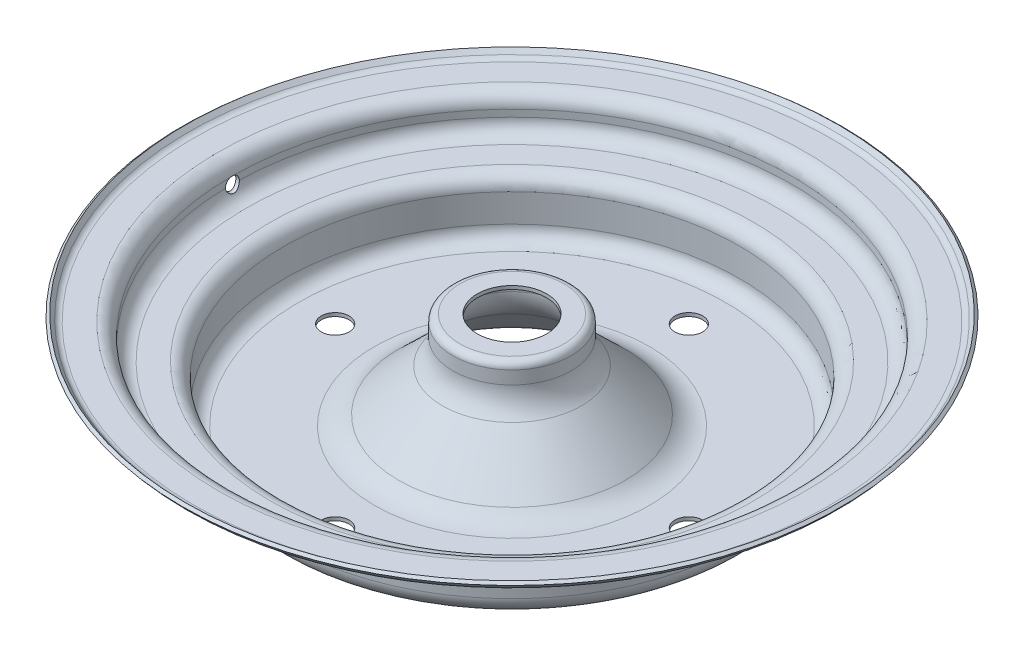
ISO-10303-21;
HEADER;
FILE_DESCRIPTION(('STEP AP214'),'2;1');
FILE_NAME('part.step','',(''),(''),'','','');
FILE_SCHEMA(('AUTOMOTIVE_DESIGN { 1 0 10303 214 1 1 1 1 }'));
ENDSEC;
DATA;
#1=APPLICATION_CONTEXT('core data for automotive mechanical design processes');
#2=APPLICATION_PROTOCOL_DEFINITION('international standard','automotive_design',2000,#1);
#3=PRODUCT_CONTEXT('',#1,'mechanical');
#4=PRODUCT('Part','Part','',(#3));
#5=PRODUCT_RELATED_PRODUCT_CATEGORY('part','',(#4));
#6=PRODUCT_DEFINITION_FORMATION('','',#4);
#7=PRODUCT_DEFINITION_CONTEXT('part definition',#1,'design');
#8=PRODUCT_DEFINITION('design','',#6,#7);
#9=PRODUCT_DEFINITION_SHAPE('','',#8);
#10=(LENGTH_UNIT() NAMED_UNIT(*) SI_UNIT(.MILLI.,.METRE.));
#11=(NAMED_UNIT(*) PLANE_ANGLE_UNIT() SI_UNIT($,.RADIAN.));
#12=(NAMED_UNIT(*) SI_UNIT($,.STERADIAN.) SOLID_ANGLE_UNIT());
#13=UNCERTAINTY_MEASURE_WITH_UNIT(LENGTH_MEASURE(1.E-05),#10,'distance_accuracy_value','');
#14=(GEOMETRIC_REPRESENTATION_CONTEXT(3) GLOBAL_UNCERTAINTY_ASSIGNED_CONTEXT((#13)) GLOBAL_UNIT_ASSIGNED_CONTEXT((#10,
#11,#12)) REPRESENTATION_CONTEXT('',''));
#15=CARTESIAN_POINT('',(0.,0.,0.));
#16=DIRECTION('',(0.,0.,1.));
#17=DIRECTION('',(1.,0.,0.));
#18=AXIS2_PLACEMENT_3D('',#15,#16,#17);
#19=CARTESIAN_POINT('',(0.,39.6036389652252,0.));
#20=DIRECTION('',(0.,1.,0.));
#21=DIRECTION('',(0.,0.,1.));
#22=AXIS2_PLACEMENT_3D('',#19,#20,#21);
#23=CYLINDRICAL_SURFACE('',#22,81.6269865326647);
#24=CARTESIAN_POINT('',(0.,26.7656449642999,0.));
#25=DIRECTION('',(0.,1.,0.));
#26=DIRECTION('',(0.,0.,1.));
#27=AXIS2_PLACEMENT_3D('',#24,#25,#26);
#28=CIRCLE('',#27,81.6269865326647);
#29=CARTESIAN_POINT('',(-81.6024811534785,26.7656449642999,2.));
#30=VERTEX_POINT('',#29);
#31=CARTESIAN_POINT('',(-81.6024811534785,26.7656449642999,-2.));
#32=VERTEX_POINT('',#31);
#33=EDGE_CURVE('E248',#30,#32,#28,.T.);
#34=ORIENTED_EDGE('',*,*,#33,.T.);
#35=CARTESIAN_POINT('',(-81.6024811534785,26.7656449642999,-2.));
#36=CARTESIAN_POINT('',(-81.6024808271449,26.8219040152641,-1.99999963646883));
#37=CARTESIAN_POINT('',(-81.6025394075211,26.8781361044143,-1.99762470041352));
#38=CARTESIAN_POINT('',(-81.6027709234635,26.9901977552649,-1.98815017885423));
#39=CARTESIAN_POINT('',(-81.6029438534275,27.046027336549,-1.98105082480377));
#40=CARTESIAN_POINT('',(-81.6036282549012,27.212219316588,-1.95273292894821));
#41=CARTESIAN_POINT('',(-81.6043053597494,27.3214681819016,-1.92449437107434));
#42=CARTESIAN_POINT('',(-81.6060260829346,27.5336676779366,-1.85008268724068));
#43=CARTESIAN_POINT('',(-81.6070698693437,27.6366153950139,-1.80390133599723));
#44=CARTESIAN_POINT('',(-81.6094058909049,27.8332920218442,-1.69492164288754));
#45=CARTESIAN_POINT('',(-81.6106980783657,27.9270226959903,-1.63212648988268));
#46=CARTESIAN_POINT('',(-81.6133857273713,28.1026292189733,-1.4916832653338));
#47=CARTESIAN_POINT('',(-81.6147812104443,28.1845025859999,-1.41403209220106));
#48=CARTESIAN_POINT('',(-81.6175181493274,28.33406581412,-1.24607454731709));
#49=CARTESIAN_POINT('',(-81.6188595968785,28.4017535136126,-1.15576625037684));
#50=CARTESIAN_POINT('',(-81.6213371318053,28.5210119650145,-0.965057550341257));
#51=CARTESIAN_POINT('',(-81.6224732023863,28.5725813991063,-0.864656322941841));
#52=CARTESIAN_POINT('',(-81.6244116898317,28.658128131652,-0.656624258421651));
#53=CARTESIAN_POINT('',(-81.6252141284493,28.6921065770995,-0.548993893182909));
#54=CARTESIAN_POINT('',(-81.6263948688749,28.7415055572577,-0.329573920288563));
#55=CARTESIAN_POINT('',(-81.6267732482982,28.7569294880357,-0.217785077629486));
#56=CARTESIAN_POINT('',(-81.6270634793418,28.7687921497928,0.00679853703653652));
#57=CARTESIAN_POINT('',(-81.6269753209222,28.7652304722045,0.11959333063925));
#58=CARTESIAN_POINT('',(-81.6263424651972,28.7392252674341,0.342957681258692));
#59=CARTESIAN_POINT('',(-81.6257978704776,28.7167859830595,0.453527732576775));
#60=CARTESIAN_POINT('',(-81.6243136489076,28.6536691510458,0.669330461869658));
#61=CARTESIAN_POINT('',(-81.6233740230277,28.612991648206,0.774563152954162));
#62=CARTESIAN_POINT('',(-81.6212054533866,28.5145472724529,0.976720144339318));
#63=CARTESIAN_POINT('',(-81.6199764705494,28.456778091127,1.07364332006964));
#64=CARTESIAN_POINT('',(-81.6173677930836,28.3257947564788,1.25641234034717));
#65=CARTESIAN_POINT('',(-81.615988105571,28.2525813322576,1.34225870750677));
#66=CARTESIAN_POINT('',(-81.6132332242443,28.0927758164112,1.50045578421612));
#67=CARTESIAN_POINT('',(-81.6118580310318,28.0061820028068,1.57280475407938));
#68=CARTESIAN_POINT('',(-81.6092669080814,27.8220416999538,1.70196168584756));
#69=CARTESIAN_POINT('',(-81.6080510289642,27.7244917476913,1.75876471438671));
#70=CARTESIAN_POINT('',(-81.6059155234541,27.5211949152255,1.85521423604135));
#71=CARTESIAN_POINT('',(-81.6049960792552,27.4154430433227,1.89485018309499));
#72=CARTESIAN_POINT('',(-81.6035596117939,27.1988654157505,1.95574340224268));
#73=CARTESIAN_POINT('',(-81.6030419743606,27.0880476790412,1.97702872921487));
#74=CARTESIAN_POINT('',(-81.6026626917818,26.9413502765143,1.9925802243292));
#75=CARTESIAN_POINT('',(-81.6025946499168,26.9062360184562,1.99536410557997));
#76=CARTESIAN_POINT('',(-81.6025039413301,26.8359675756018,1.99907145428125));
#77=CARTESIAN_POINT('',(-81.6024811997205,26.8008135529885,1.99999799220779));
#78=CARTESIAN_POINT('',(-81.6024811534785,26.7656449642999,2.));
#79=B_SPLINE_CURVE_WITH_KNOTS('',3,(#35,#36,#37,#38,#39,#40,#41,#42,#43,#44,#45,#46,#47,#48,#49,
#50,#51,#52,#53,#54,#55,#56,#57,#58,#59,#60,#61,#62,#63,#64,#65,#66,#67,#68,#69,#70,#71,#72,#73,
#74,#75,#76,#77,#78),.UNSPECIFIED.,.F.,.F.,(4,2,2,2,2,2,2,2,2,2,2,2,2,2,2,2,2,2,2,2,2,4),(0.,
0.168673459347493,0.337338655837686,0.674126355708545,1.01106862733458,1.34794627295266,
1.68489432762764,2.02189368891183,2.3589205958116,2.69592552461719,3.03286876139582,
3.36981924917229,3.70669402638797,4.04356797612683,4.38048744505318,4.71739101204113,
5.05433797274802,5.39139173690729,5.7286522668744,6.06539626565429,6.17103547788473,
6.27649990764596),.UNSPECIFIED.);
#80=CARTESIAN_POINT('',(-81.6269865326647,28.7656449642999,0.));
#81=VERTEX_POINT('',#80);
#82=EDGE_CURVE('E52',#32,#81,#79,.T.);
#83=ORIENTED_EDGE('',*,*,#82,.T.);
#84=CARTESIAN_POINT('',(0.,28.7656449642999,0.));
#85=DIRECTION('',(0.,1.,0.));
#86=DIRECTION('',(0.,0.,1.));
#87=AXIS2_PLACEMENT_3D('',#84,#85,#86);
#88=CIRCLE('',#87,81.6269865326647);
#89=EDGE_CURVE('E251',#81,#81,#88,.T.);
#90=ORIENTED_EDGE('',*,*,#89,.F.);
#91=EDGE_CURVE('E112',#81,#30,#79,.T.);
#92=ORIENTED_EDGE('',*,*,#91,.T.);
#93=EDGE_LOOP('',(#34,#83,#90,#92));
#94=FACE_BOUND('',#93,.T.);
#95=ADVANCED_FACE('F37',(#94),#23,.T.);
#96=CARTESIAN_POINT('',(0.,26.7656449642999,0.));
#97=DIRECTION('',(0.,1.,0.));
#98=DIRECTION('',(0.,0.,1.));
#99=AXIS2_PLACEMENT_3D('',#96,#97,#98);
#100=TOROIDAL_SURFACE('',#99,76.6269865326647,5.);
#101=CARTESIAN_POINT('',(0.,21.7656449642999,0.));
#102=DIRECTION('',(0.,1.,0.));
#103=DIRECTION('',(0.,0.,1.));
#104=AXIS2_PLACEMENT_3D('',#101,#102,#103);
#105=CIRCLE('',#104,76.6269865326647);
#106=CARTESIAN_POINT('',(0.,21.7656449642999,76.6269865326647));
#107=VERTEX_POINT('',#106);
#108=EDGE_CURVE('E245',#107,#107,#105,.T.);
#109=ORIENTED_EDGE('',*,*,#108,.T.);
#110=EDGE_LOOP('',(#109));
#111=FACE_BOUND('',#110,.T.);
#112=ORIENTED_EDGE('',*,*,#33,.F.);
#113=CARTESIAN_POINT('',(-81.6024811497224,26.7658449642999,1.99999999));
#114=CARTESIAN_POINT('',(-81.6024907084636,26.7116224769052,2.00001276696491));
#115=CARTESIAN_POINT('',(-81.6016571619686,26.6574044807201,1.99780593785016));
#116=CARTESIAN_POINT('',(-81.598359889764,26.5493891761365,1.98901010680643));
#117=CARTESIAN_POINT('',(-81.5958966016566,26.4955917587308,1.98242228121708));
#118=CARTESIAN_POINT('',(-81.5894060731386,26.3889681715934,1.96494903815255));
#119=CARTESIAN_POINT('',(-81.5853837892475,26.3361394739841,1.95407723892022));
#120=CARTESIAN_POINT('',(-81.5758859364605,26.2316656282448,1.92815111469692));
#121=CARTESIAN_POINT('',(-81.5704103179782,26.180020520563,1.91309664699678));
#122=CARTESIAN_POINT('',(-81.5520076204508,26.0274510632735,1.86186686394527));
#123=CARTESIAN_POINT('',(-81.5370944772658,25.9287345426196,1.81959892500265));
#124=CARTESIAN_POINT('',(-81.5034369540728,25.739827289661,1.72020955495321));
#125=CARTESIAN_POINT('',(-81.4846901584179,25.6496419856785,1.66307875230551));
#126=CARTESIAN_POINT('',(-81.4443952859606,25.4765125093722,1.53306568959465));
#127=CARTESIAN_POINT('',(-81.4227678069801,25.3939739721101,1.45966717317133));
#128=CARTESIAN_POINT('',(-81.3795107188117,25.2420458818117,1.30029862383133));
#129=CARTESIAN_POINT('',(-81.3578811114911,25.1726609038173,1.21432423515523));
#130=CARTESIAN_POINT('',(-81.3161341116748,25.0463195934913,1.02813522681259));
#131=CARTESIAN_POINT('',(-81.2961093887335,24.9899579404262,0.927494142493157));
#132=CARTESIAN_POINT('',(-81.2611119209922,24.8951449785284,0.717291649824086));
#133=CARTESIAN_POINT('',(-81.24613691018,24.8566856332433,0.607734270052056));
#134=CARTESIAN_POINT('',(-81.2238192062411,24.8003997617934,0.387535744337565));
#135=CARTESIAN_POINT('',(-81.2161870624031,24.7817873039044,0.277125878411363));
#136=CARTESIAN_POINT('',(-81.2085967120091,24.7632736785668,0.0545046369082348));
#137=CARTESIAN_POINT('',(-81.2086353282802,24.7633647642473,-0.0577059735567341));
#138=CARTESIAN_POINT('',(-81.2161250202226,24.7816387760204,-0.273304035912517));
#139=CARTESIAN_POINT('',(-81.2231146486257,24.7986954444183,-0.3768059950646));
#140=CARTESIAN_POINT('',(-81.2429368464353,24.8485547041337,-0.579350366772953));
#141=CARTESIAN_POINT('',(-81.2557702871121,24.8813596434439,-0.678392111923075));
#142=CARTESIAN_POINT('',(-81.2860881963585,24.9624010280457,-0.871489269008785));
#143=CARTESIAN_POINT('',(-81.3036589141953,25.0109273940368,-0.965408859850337));
#144=CARTESIAN_POINT('',(-81.3414218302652,25.1218369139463,-1.14409904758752));
#145=CARTESIAN_POINT('',(-81.3616149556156,25.1842249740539,-1.22886638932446));
#146=CARTESIAN_POINT('',(-81.4040423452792,25.3261795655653,-1.39302299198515));
#147=CARTESIAN_POINT('',(-81.4263210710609,25.4066370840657,-1.471632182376));
#148=CARTESIAN_POINT('',(-81.4692066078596,25.5798732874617,-1.61448139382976));
#149=CARTESIAN_POINT('',(-81.4898129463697,25.6726554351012,-1.67871736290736));
#150=CARTESIAN_POINT('',(-81.5274628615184,25.8698496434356,-1.79183562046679));
#151=CARTESIAN_POINT('',(-81.5444450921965,25.9744221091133,-1.84045965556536));
#152=CARTESIAN_POINT('',(-81.572490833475,26.1910154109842,-1.91912108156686));
#153=CARTESIAN_POINT('',(-81.5835631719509,26.3030248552,-1.94918620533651));
#154=CARTESIAN_POINT('',(-81.5948260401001,26.4744325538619,-1.97955159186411));
#155=CARTESIAN_POINT('',(-81.5976900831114,26.532441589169,-1.98721875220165));
#156=CARTESIAN_POINT('',(-81.6015206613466,26.6489044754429,-1.99744425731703));
#157=CARTESIAN_POINT('',(-81.6024893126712,26.7073577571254,-2.00000829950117));
#158=CARTESIAN_POINT('',(-81.6024811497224,26.7658449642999,-1.99999999));
#159=B_SPLINE_CURVE_WITH_KNOTS('',3,(#113,#114,#115,#116,#117,#118,#119,#120,#121,#122,#123,
#124,#125,#126,#127,#128,#129,#130,#131,#132,#133,#134,#135,#136,#137,#138,#139,#140,#141,#142,
#143,#144,#145,#146,#147,#148,#149,#150,#151,#152,#153,#154,#155,#156,#157,#158),.UNSPECIFIED.,
.F.,.F.,(4,2,2,2,2,2,2,2,2,2,2,2,2,2,2,2,2,2,2,2,2,2,4),(0.,0.162607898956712,0.32517215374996,
0.487223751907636,0.649280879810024,0.972919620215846,1.29676292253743,1.63291788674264,
1.96918955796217,2.31865919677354,2.66797180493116,3.00286988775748,3.33762925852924,
3.6515556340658,3.96552882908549,4.28565735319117,4.60589936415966,4.94833929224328,
5.29087563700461,5.63881675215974,5.98623666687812,6.16176337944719,6.33709401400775),.UNSPECIFIED.);
#160=EDGE_CURVE('E82',#30,#32,#159,.T.);
#161=ORIENTED_EDGE('',*,*,#160,.T.);
#162=EDGE_LOOP('',(#112,#161));
#163=FACE_BOUND('',#162,.T.);
#164=ADVANCED_FACE('F119',(#111,#163),#100,.T.);
#165=CARTESIAN_POINT('',(0.,26.7656449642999,0.));
#166=DIRECTION('',(0.,1.,0.));
#167=DIRECTION('',(0.,0.,1.));
#168=AXIS2_PLACEMENT_3D('',#165,#166,#167);
#169=TOROIDAL_SURFACE('',#168,76.6269865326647,4.);
#170=CARTESIAN_POINT('',(0.,22.7656449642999,0.));
#171=DIRECTION('',(0.,1.,0.));
#172=DIRECTION('',(0.,0.,1.));
#173=AXIS2_PLACEMENT_3D('',#170,#171,#172);
#174=CIRCLE('',#173,76.6269865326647);
#175=CARTESIAN_POINT('',(0.,22.7656449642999,76.6269865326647));
#176=VERTEX_POINT('',#175);
#177=EDGE_CURVE('E176',#176,#176,#174,.T.);
#178=ORIENTED_EDGE('',*,*,#177,.F.);
#179=EDGE_LOOP('',(#178));
#180=FACE_BOUND('',#179,.T.);
#181=CARTESIAN_POINT('',(0.,26.7656449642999,0.));
#182=DIRECTION('',(0.,1.,0.));
#183=DIRECTION('',(0.,0.,1.));
#184=AXIS2_PLACEMENT_3D('',#181,#182,#183);
#185=CIRCLE('',#184,80.6269865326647);
#186=CARTESIAN_POINT('',(-80.6021771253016,26.7656449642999,2.));
#187=VERTEX_POINT('',#186);
#188=CARTESIAN_POINT('',(-80.6021771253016,26.7656449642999,-2.));
#189=VERTEX_POINT('',#188);
#190=EDGE_CURVE('E81',#187,#189,#185,.T.);
#191=ORIENTED_EDGE('',*,*,#190,.T.);
#192=CARTESIAN_POINT('',(-80.6021771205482,26.7658449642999,-1.99999999));
#193=CARTESIAN_POINT('',(-80.6021884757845,26.7127679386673,-2.00001354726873));
#194=CARTESIAN_POINT('',(-80.6011780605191,26.6596963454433,-1.99789794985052));
#195=CARTESIAN_POINT('',(-80.5971798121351,26.553981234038,-1.98947241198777));
#196=CARTESIAN_POINT('',(-80.5941927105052,26.5013375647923,-1.98316402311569));
#197=CARTESIAN_POINT('',(-80.5863237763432,26.3970763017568,-1.96645215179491));
#198=CARTESIAN_POINT('',(-80.5814499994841,26.3454553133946,-1.95606607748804));
#199=CARTESIAN_POINT('',(-80.5699360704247,26.2433874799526,-1.93132294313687));
#200=CARTESIAN_POINT('',(-80.5632958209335,26.1929406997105,-1.91696566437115));
#201=CARTESIAN_POINT('',(-80.5409687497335,26.0439794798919,-1.86817659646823));
#202=CARTESIAN_POINT('',(-80.5228593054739,25.9476403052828,-1.82799432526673));
#203=CARTESIAN_POINT('',(-80.4818313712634,25.7631525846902,-1.73371742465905));
#204=CARTESIAN_POINT('',(-80.4589084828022,25.6750116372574,-1.67961006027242));
#205=CARTESIAN_POINT('',(-80.4088870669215,25.5039737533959,-1.55561713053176));
#206=CARTESIAN_POINT('',(-80.3816277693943,25.4216359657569,-1.48502474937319));
#207=CARTESIAN_POINT('',(-80.3265226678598,25.269462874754,-1.33158928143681));
#208=CARTESIAN_POINT('',(-80.2986765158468,25.1996352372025,-1.2487387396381));
#209=CARTESIAN_POINT('',(-80.2433046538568,25.0695332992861,-1.06613083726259));
#210=CARTESIAN_POINT('',(-80.2159392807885,25.0102765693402,-0.965594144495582));
#211=CARTESIAN_POINT('',(-80.1673540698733,24.9097550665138,-0.754526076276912));
#212=CARTESIAN_POINT('',(-80.1461299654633,24.8684777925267,-0.644001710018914));
#213=CARTESIAN_POINT('',(-80.114099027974,24.8076020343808,-0.422488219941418));
#214=CARTESIAN_POINT('',(-80.1027709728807,24.7869096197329,-0.311878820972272));
#215=CARTESIAN_POINT('',(-80.0904489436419,24.764440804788,-0.0882231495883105));
#216=CARTESIAN_POINT('',(-80.0894460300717,24.7626480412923,0.0248209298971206));
#217=CARTESIAN_POINT('',(-80.0974430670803,24.7771850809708,0.236753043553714));
#218=CARTESIAN_POINT('',(-80.1053521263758,24.791538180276,0.335827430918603));
#219=CARTESIAN_POINT('',(-80.1283696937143,24.8345690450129,0.529937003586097));
#220=CARTESIAN_POINT('',(-80.1434802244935,24.8632508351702,0.624971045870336));
#221=CARTESIAN_POINT('',(-80.1795269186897,24.9347041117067,0.811070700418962));
#222=CARTESIAN_POINT('',(-80.2005943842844,24.9777977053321,0.901986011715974));
#223=CARTESIAN_POINT('',(-80.2461446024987,25.0766213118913,1.07573203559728));
#224=CARTESIAN_POINT('',(-80.2706289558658,25.1323572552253,1.15855892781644));
#225=CARTESIAN_POINT('',(-80.3237170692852,25.2625442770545,1.32402116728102));
#226=CARTESIAN_POINT('',(-80.3524666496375,25.3384254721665,1.40548840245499));
#227=CARTESIAN_POINT('',(-80.4084706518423,25.5029742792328,1.55499987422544));
#228=CARTESIAN_POINT('',(-80.4357243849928,25.5916477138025,1.62303796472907));
#229=CARTESIAN_POINT('',(-80.4869856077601,25.7836408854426,1.74618697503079));
#230=CARTESIAN_POINT('',(-80.5108262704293,25.8873951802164,1.80069442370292));
#231=CARTESIAN_POINT('',(-80.5512364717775,26.1039817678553,1.89100818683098));
#232=CARTESIAN_POINT('',(-80.5678182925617,26.2167983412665,1.92684611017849));
#233=CARTESIAN_POINT('',(-80.5871372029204,26.4031483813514,1.96821780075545));
#234=CARTESIAN_POINT('',(-80.5927478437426,26.4750308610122,1.98010954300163));
#235=CARTESIAN_POINT('',(-80.6002824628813,26.6198717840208,1.99601497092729));
#236=CARTESIAN_POINT('',(-80.6022053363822,26.6928305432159,2.00002629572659));
#237=CARTESIAN_POINT('',(-80.6021771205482,26.7658449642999,1.99999999));
#238=B_SPLINE_CURVE_WITH_KNOTS('',3,(#192,#193,#194,#195,#196,#197,#198,#199,#200,#201,#202,
#203,#204,#205,#206,#207,#208,#209,#210,#211,#212,#213,#214,#215,#216,#217,#218,#219,#220,#221,
#222,#223,#224,#225,#226,#227,#228,#229,#230,#231,#232,#233,#234,#235,#236,#237),.UNSPECIFIED.,
.F.,.F.,(4,2,2,2,2,2,2,2,2,2,2,2,2,2,2,2,2,2,2,2,2,2,4),(0.,0.159169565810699,0.318280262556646,
0.476718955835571,0.635166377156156,0.951447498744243,1.26801890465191,1.60208851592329,
1.93636213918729,2.29415031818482,2.65168932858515,2.98900959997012,3.32603779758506,
3.62589947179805,3.92584542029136,4.23300128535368,4.54030153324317,4.88374201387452,
5.22733931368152,5.58425817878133,5.94057077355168,6.15930909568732,6.37811293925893),.UNSPECIFIED.);
#239=EDGE_CURVE('E60',#189,#187,#238,.T.);
#240=ORIENTED_EDGE('',*,*,#239,.T.);
#241=EDGE_LOOP('',(#191,#240));
#242=FACE_BOUND('',#241,.T.);
#243=ADVANCED_FACE('F123',(#180,#242),#169,.F.);
#244=CARTESIAN_POINT('',(0.,39.6036389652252,0.));
#245=DIRECTION('',(0.,1.,0.));
#246=DIRECTION('',(0.,0.,1.));
#247=AXIS2_PLACEMENT_3D('',#244,#245,#246);
#248=CYLINDRICAL_SURFACE('',#247,80.6269865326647);
#249=ORIENTED_EDGE('',*,*,#190,.F.);
#250=CARTESIAN_POINT('',(-80.6021771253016,26.7656449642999,2.));
#251=CARTESIAN_POINT('',(-80.6021767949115,26.8219037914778,1.99999963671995));
#252=CARTESIAN_POINT('',(-80.60223610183,26.8781356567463,1.99762471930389));
#253=CARTESIAN_POINT('',(-80.6024704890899,26.9901968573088,1.98815027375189));
#254=CARTESIAN_POINT('',(-80.6026455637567,27.0460262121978,1.9810509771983));
#255=CARTESIAN_POINT('',(-80.603338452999,27.2122174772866,1.95273332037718));
#256=CARTESIAN_POINT('',(-80.6040239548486,27.3214658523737,1.92449501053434));
#257=CARTESIAN_POINT('',(-80.6057660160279,27.5336643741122,1.85008402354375));
#258=CARTESIAN_POINT('',(-80.606822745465,27.6366116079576,1.803903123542));
#259=CARTESIAN_POINT('',(-80.6091877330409,27.8332873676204,1.69492453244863));
#260=CARTESIAN_POINT('',(-80.6104959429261,27.9270176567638,1.63213002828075));
#261=CARTESIAN_POINT('',(-80.613216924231,28.102623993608,1.491687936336));
#262=CARTESIAN_POINT('',(-80.614629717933,28.1844975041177,1.41403717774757));
#263=CARTESIAN_POINT('',(-80.6174006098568,28.3340611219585,1.24608043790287));
#264=CARTESIAN_POINT('',(-80.6187586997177,28.4017490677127,1.15577253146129));
#265=CARTESIAN_POINT('',(-80.6212669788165,28.5210083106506,0.965064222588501));
#266=CARTESIAN_POINT('',(-80.6224171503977,28.5725782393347,0.864662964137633));
#267=CARTESIAN_POINT('',(-80.6243797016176,28.6581259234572,0.656630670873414));
#268=CARTESIAN_POINT('',(-80.6251921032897,28.6921048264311,0.549000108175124));
#269=CARTESIAN_POINT('',(-80.6263875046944,28.7415045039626,0.329580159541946));
#270=CARTESIAN_POINT('',(-80.626770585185,28.7569287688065,0.217791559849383));
#271=CARTESIAN_POINT('',(-80.627064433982,28.7687921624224,-0.00679164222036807));
#272=CARTESIAN_POINT('',(-80.6269751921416,28.7652308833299,-0.119586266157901));
#273=CARTESIAN_POINT('',(-80.6263345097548,28.7392266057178,-0.342949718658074));
#274=CARTESIAN_POINT('',(-80.6257831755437,28.7167879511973,-0.453519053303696));
#275=CARTESIAN_POINT('',(-80.6242805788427,28.6536726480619,-0.669320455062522));
#276=CARTESIAN_POINT('',(-80.623329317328,28.6129960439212,-0.774552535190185));
#277=CARTESIAN_POINT('',(-80.6211338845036,28.5145535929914,-0.976708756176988));
#278=CARTESIAN_POINT('',(-80.6198896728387,28.4567853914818,-1.0736317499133));
#279=CARTESIAN_POINT('',(-80.6172486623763,28.3258041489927,-1.25640061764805));
#280=CARTESIAN_POINT('',(-80.6158518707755,28.2525918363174,-1.34224701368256));
#281=CARTESIAN_POINT('',(-80.6130628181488,28.0927880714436,-1.50044494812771));
#282=CARTESIAN_POINT('',(-80.6116705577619,28.006194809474,-1.57279465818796));
#283=CARTESIAN_POINT('',(-80.6090472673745,27.822055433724,-1.70195316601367));
#284=CARTESIAN_POINT('',(-80.607816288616,27.7245058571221,-1.75875703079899));
#285=CARTESIAN_POINT('',(-80.6056542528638,27.5212095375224,-1.85520828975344));
#286=CARTESIAN_POINT('',(-80.6047233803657,27.4154578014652,-1.89484513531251));
#287=CARTESIAN_POINT('',(-80.6032690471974,27.1988802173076,-1.95574013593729));
#288=CARTESIAN_POINT('',(-80.6027449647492,27.0880623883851,-1.97702634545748));
#289=CARTESIAN_POINT('',(-80.6023609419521,26.9413624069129,-1.99257919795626));
#290=CARTESIAN_POINT('',(-80.6022920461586,26.9062457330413,-1.99536346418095));
#291=CARTESIAN_POINT('',(-80.6022001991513,26.8359724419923,-1.99907132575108));
#292=CARTESIAN_POINT('',(-80.6021771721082,26.8008159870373,-1.99999799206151));
#293=CARTESIAN_POINT('',(-80.6021771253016,26.7656449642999,-2.));
#294=B_SPLINE_CURVE_WITH_KNOTS('',3,(#250,#251,#252,#253,#254,#255,#256,#257,#258,#259,#260,
#261,#262,#263,#264,#265,#266,#267,#268,#269,#270,#271,#272,#273,#274,#275,#276,#277,#278,#279,
#280,#281,#282,#283,#284,#285,#286,#287,#288,#289,#290,#291,#292,#293),.UNSPECIFIED.,.F.,.F.,(4,
2,2,2,2,2,2,2,2,2,2,2,2,2,2,2,2,2,2,2,2,4),(0.,0.168672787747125,0.337337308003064,
0.674123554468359,1.01106432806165,1.34794051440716,1.68488868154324,2.02188815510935,
2.3589162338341,2.69592232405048,3.03286501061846,3.36981493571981,3.70668734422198,
4.04355893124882,4.38047695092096,4.71737908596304,5.05432682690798,5.39138136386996,
5.72864271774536,6.06538754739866,6.17103407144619,6.27650579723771),.UNSPECIFIED.);
#295=CARTESIAN_POINT('',(-80.6269865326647,28.7656449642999,0.));
#296=VERTEX_POINT('',#295);
#297=EDGE_CURVE('E72',#187,#296,#294,.T.);
#298=ORIENTED_EDGE('',*,*,#297,.T.);
#299=CARTESIAN_POINT('',(0.,28.7656449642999,0.));
#300=DIRECTION('',(0.,1.,0.));
#301=DIRECTION('',(0.,0.,1.));
#302=AXIS2_PLACEMENT_3D('',#299,#300,#301);
#303=CIRCLE('',#302,80.6269865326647);
#304=EDGE_CURVE('E80',#296,#296,#303,.T.);
#305=ORIENTED_EDGE('',*,*,#304,.T.);
#306=EDGE_CURVE('E69',#296,#189,#294,.T.);
#307=ORIENTED_EDGE('',*,*,#306,.T.);
#308=EDGE_LOOP('',(#249,#298,#305,#307));
#309=FACE_BOUND('',#308,.T.);
#310=ADVANCED_FACE('F78',(#309),#248,.F.);
#311=CARTESIAN_POINT('',(0.,34.6807560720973,0.));
#312=DIRECTION('',(0.,-1.,0.));
#313=DIRECTION('',(0.,0.,-1.));
#314=AXIS2_PLACEMENT_3D('',#311,#312,#313);
#315=CONICAL_SURFACE('',#314,94.233955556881,0.872664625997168);
#316=CARTESIAN_POINT('',(0.,34.0379684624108,0.));
#317=DIRECTION('',(0.,1.,0.));
#318=DIRECTION('',(0.,0.,1.));
#319=AXIS2_PLACEMENT_3D('',#316,#317,#318);
#320=CIRCLE('',#319,95.);
#321=CARTESIAN_POINT('',(0.,34.0379684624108,95.));
#322=VERTEX_POINT('',#321);
#323=EDGE_CURVE('E11',#322,#322,#320,.T.);
#324=ORIENTED_EDGE('',*,*,#323,.T.);
#325=EDGE_LOOP('',(#324));
#326=FACE_BOUND('',#325,.T.);
#327=CARTESIAN_POINT('',(0.,34.6807560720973,0.));
#328=DIRECTION('',(0.,1.,0.));
#329=DIRECTION('',(0.,0.,1.));
#330=AXIS2_PLACEMENT_3D('',#327,#328,#329);
#331=CIRCLE('',#330,94.233955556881);
#332=CARTESIAN_POINT('',(0.,34.6807560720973,94.233955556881));
#333=VERTEX_POINT('',#332);
#334=EDGE_CURVE('E156',#333,#333,#331,.T.);
#335=ORIENTED_EDGE('',*,*,#334,.F.);
#336=EDGE_LOOP('',(#335));
#337=FACE_BOUND('',#336,.T.);
#338=ADVANCED_FACE('F39',(#326,#337),#315,.T.);
#339=CARTESIAN_POINT('',(0.,34.0379684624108,0.));
#340=DIRECTION('',(0.,1.,0.));
#341=DIRECTION('',(0.,0.,1.));
#342=AXIS2_PLACEMENT_3D('',#339,#340,#341);
#343=CONICAL_SURFACE('',#342,95.,0.698131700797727);
#344=CARTESIAN_POINT('',(0.,32.8372821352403,0.));
#345=DIRECTION('',(0.,1.,0.));
#346=DIRECTION('',(0.,0.,1.));
#347=AXIS2_PLACEMENT_3D('',#344,#345,#346);
#348=CIRCLE('',#347,93.9925045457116);
#349=CARTESIAN_POINT('',(0.,32.8372821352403,93.9925045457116));
#350=VERTEX_POINT('',#349);
#351=EDGE_CURVE('E45',#350,#350,#348,.T.);
#352=ORIENTED_EDGE('',*,*,#351,.T.);
#353=EDGE_LOOP('',(#352));
#354=FACE_BOUND('',#353,.T.);
#355=ORIENTED_EDGE('',*,*,#323,.F.);
#356=EDGE_LOOP('',(#355));
#357=FACE_BOUND('',#356,.T.);
#358=ADVANCED_FACE('F141',(#354,#357),#343,.T.);
#359=CARTESIAN_POINT('',(0.,34.7656449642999,0.));
#360=DIRECTION('',(0.,1.,0.));
#361=DIRECTION('',(0.,0.,1.));
#362=AXIS2_PLACEMENT_3D('',#359,#360,#361);
#363=TOROIDAL_SURFACE('',#362,91.6943712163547,3.);
#364=CARTESIAN_POINT('',(0.,31.7656449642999,0.));
#365=DIRECTION('',(0.,1.,0.));
#366=DIRECTION('',(0.,0.,1.));
#367=AXIS2_PLACEMENT_3D('',#364,#365,#366);
#368=CIRCLE('',#367,91.6943712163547);
#369=CARTESIAN_POINT('',(0.,31.7656449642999,91.6943712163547));
#370=VERTEX_POINT('',#369);
#371=EDGE_CURVE('E257',#370,#370,#368,.T.);
#372=ORIENTED_EDGE('',*,*,#371,.T.);
#373=EDGE_LOOP('',(#372));
#374=FACE_BOUND('',#373,.T.);
#375=ORIENTED_EDGE('',*,*,#351,.F.);
#376=EDGE_LOOP('',(#375));
#377=FACE_BOUND('',#376,.T.);
#378=ADVANCED_FACE('F138',(#374,#377),#363,.T.);
#379=CARTESIAN_POINT('',(-91.6943712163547,31.7656449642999,0.));
#380=DIRECTION('',(0.,-1.,0.));
#381=DIRECTION('',(0.,0.,-1.));
#382=AXIS2_PLACEMENT_3D('',#379,#380,#381);
#383=PLANE('',#382);
#384=CARTESIAN_POINT('',(0.,31.7656449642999,0.));
#385=DIRECTION('',(0.,1.,0.));
#386=DIRECTION('',(0.,0.,1.));
#387=AXIS2_PLACEMENT_3D('',#384,#385,#386);
#388=CIRCLE('',#387,84.6269865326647);
#389=CARTESIAN_POINT('',(0.,31.7656449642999,84.6269865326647));
#390=VERTEX_POINT('',#389);
#391=EDGE_CURVE('E254',#390,#390,#388,.T.);
#392=ORIENTED_EDGE('',*,*,#391,.T.);
#393=EDGE_LOOP('',(#392));
#394=FACE_BOUND('',#393,.T.);
#395=ORIENTED_EDGE('',*,*,#371,.F.);
#396=EDGE_LOOP('',(#395));
#397=FACE_BOUND('',#396,.T.);
#398=ADVANCED_FACE('F134',(#394,#397),#383,.T.);
#399=CARTESIAN_POINT('',(0.,28.7656449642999,0.));
#400=DIRECTION('',(0.,1.,0.));
#401=DIRECTION('',(0.,0.,1.));
#402=AXIS2_PLACEMENT_3D('',#399,#400,#401);
#403=TOROIDAL_SURFACE('',#402,84.6269865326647,3.);
#404=ORIENTED_EDGE('',*,*,#89,.T.);
#405=EDGE_LOOP('',(#404));
#406=FACE_BOUND('',#405,.T.);
#407=ORIENTED_EDGE('',*,*,#391,.F.);
#408=EDGE_LOOP('',(#407));
#409=FACE_BOUND('',#408,.T.);
#410=ADVANCED_FACE('F131',(#406,#409),#403,.F.);
#411=CARTESIAN_POINT('',(-76.6269865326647,21.7656449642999,0.));
#412=DIRECTION('',(0.,-1.,0.));
#413=DIRECTION('',(0.,0.,-1.));
#414=AXIS2_PLACEMENT_3D('',#411,#412,#413);
#415=PLANE('',#414);
#416=CARTESIAN_POINT('',(0.,21.7656449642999,0.));
#417=DIRECTION('',(0.,1.,0.));
#418=DIRECTION('',(0.,0.,1.));
#419=AXIS2_PLACEMENT_3D('',#416,#417,#418);
#420=CIRCLE('',#419,69.6269865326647);
#421=CARTESIAN_POINT('',(0.,21.7656449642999,69.6269865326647));
#422=VERTEX_POINT('',#421);
#423=EDGE_CURVE('E242',#422,#422,#420,.T.);
#424=ORIENTED_EDGE('',*,*,#423,.T.);
#425=EDGE_LOOP('',(#424));
#426=FACE_BOUND('',#425,.T.);
#427=ORIENTED_EDGE('',*,*,#108,.F.);
#428=EDGE_LOOP('',(#427));
#429=FACE_BOUND('',#428,.T.);
#430=ADVANCED_FACE('F125',(#426,#429),#415,.T.);
#431=CARTESIAN_POINT('',(0.,18.7656449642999,0.));
#432=DIRECTION('',(0.,1.,0.));
#433=DIRECTION('',(0.,0.,1.));
#434=AXIS2_PLACEMENT_3D('',#431,#432,#433);
#435=TOROIDAL_SURFACE('',#434,69.6269865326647,3.);
#436=CARTESIAN_POINT('',(0.,18.7656449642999,0.));
#437=DIRECTION('',(0.,1.,0.));
#438=DIRECTION('',(0.,0.,1.));
#439=AXIS2_PLACEMENT_3D('',#436,#437,#438);
#440=CIRCLE('',#439,66.6269865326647);
#441=CARTESIAN_POINT('',(0.,18.7656449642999,66.6269865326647));
#442=VERTEX_POINT('',#441);
#443=EDGE_CURVE('E239',#442,#442,#440,.T.);
#444=ORIENTED_EDGE('',*,*,#443,.T.);
#445=EDGE_LOOP('',(#444));
#446=FACE_BOUND('',#445,.T.);
#447=ORIENTED_EDGE('',*,*,#423,.F.);
#448=EDGE_LOOP('',(#447));
#449=FACE_BOUND('',#448,.T.);
#450=ADVANCED_FACE('F313',(#446,#449),#435,.F.);
#451=CARTESIAN_POINT('',(0.,39.6036389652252,0.));
#452=DIRECTION('',(0.,1.,0.));
#453=DIRECTION('',(0.,0.,1.));
#454=AXIS2_PLACEMENT_3D('',#451,#452,#453);
#455=CYLINDRICAL_SURFACE('',#454,66.6269865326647);
#456=CARTESIAN_POINT('',(0.,10.6807560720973,0.));
#457=DIRECTION('',(0.,1.,0.));
#458=DIRECTION('',(0.,0.,1.));
#459=AXIS2_PLACEMENT_3D('',#456,#457,#458);
#460=CIRCLE('',#459,66.6269865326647);
#461=CARTESIAN_POINT('',(0.,10.6807560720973,66.6269865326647));
#462=VERTEX_POINT('',#461);
#463=EDGE_CURVE('E236',#462,#462,#460,.T.);
#464=ORIENTED_EDGE('',*,*,#463,.T.);
#465=EDGE_LOOP('',(#464));
#466=FACE_BOUND('',#465,.T.);
#467=ORIENTED_EDGE('',*,*,#443,.F.);
#468=EDGE_LOOP('',(#467));
#469=FACE_BOUND('',#468,.T.);
#470=ADVANCED_FACE('F307',(#466,#469),#455,.T.);
#471=CARTESIAN_POINT('',(0.,10.6807560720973,0.));
#472=DIRECTION('',(0.,1.,0.));
#473=DIRECTION('',(0.,0.,1.));
#474=AXIS2_PLACEMENT_3D('',#471,#472,#473);
#475=TOROIDAL_SURFACE('',#474,61.6269865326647,5.);
#476=CARTESIAN_POINT('',(0.,5.68075607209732,0.));
#477=DIRECTION('',(0.,1.,0.));
#478=DIRECTION('',(0.,0.,1.));
#479=AXIS2_PLACEMENT_3D('',#476,#477,#478);
#480=CIRCLE('',#479,61.6269865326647);
#481=CARTESIAN_POINT('',(0.,5.68075607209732,61.6269865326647));
#482=VERTEX_POINT('',#481);
#483=EDGE_CURVE('E233',#482,#482,#480,.T.);
#484=ORIENTED_EDGE('',*,*,#483,.T.);
#485=EDGE_LOOP('',(#484));
#486=FACE_BOUND('',#485,.T.);
#487=ORIENTED_EDGE('',*,*,#463,.F.);
#488=EDGE_LOOP('',(#487));
#489=FACE_BOUND('',#488,.T.);
#490=ADVANCED_FACE('F294',(#486,#489),#475,.T.);
#491=CARTESIAN_POINT('',(-61.6269865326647,5.68075607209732,0.));
#492=DIRECTION('',(0.,-1.,0.));
#493=DIRECTION('',(0.,0.,-1.));
#494=AXIS2_PLACEMENT_3D('',#491,#492,#493);
#495=PLANE('',#494);
#496=CARTESIAN_POINT('',(0.,5.68075607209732,-50.9725));
#497=DIRECTION('',(0.,-1.,0.));
#498=DIRECTION('',(0.,0.,-1.));
#499=AXIS2_PLACEMENT_3D('',#496,#497,#498);
#500=CIRCLE('',#499,4.);
#501=CARTESIAN_POINT('',(0.,5.68075607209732,-54.9725));
#502=VERTEX_POINT('',#501);
#503=EDGE_CURVE('E159',#502,#502,#500,.T.);
#504=ORIENTED_EDGE('',*,*,#503,.F.);
#505=EDGE_LOOP('',(#504));
#506=FACE_BOUND('',#505,.T.);
#507=CARTESIAN_POINT('',(50.9725,5.68075607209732,0.));
#508=DIRECTION('',(0.,-1.,0.));
#509=DIRECTION('',(0.,0.,-1.));
#510=AXIS2_PLACEMENT_3D('',#507,#508,#509);
#511=CIRCLE('',#510,4.);
#512=CARTESIAN_POINT('',(50.9725,5.68075607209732,-4.));
#513=VERTEX_POINT('',#512);
#514=EDGE_CURVE('E165',#513,#513,#511,.T.);
#515=ORIENTED_EDGE('',*,*,#514,.F.);
#516=EDGE_LOOP('',(#515));
#517=FACE_BOUND('',#516,.T.);
#518=CARTESIAN_POINT('',(0.,5.68075607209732,50.9725));
#519=DIRECTION('',(0.,-1.,0.));
#520=DIRECTION('',(0.,0.,-1.));
#521=AXIS2_PLACEMENT_3D('',#518,#519,#520);
#522=CIRCLE('',#521,4.);
#523=CARTESIAN_POINT('',(0.,5.68075607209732,46.9725));
#524=VERTEX_POINT('',#523);
#525=EDGE_CURVE('E281',#524,#524,#522,.T.);
#526=ORIENTED_EDGE('',*,*,#525,.F.);
#527=EDGE_LOOP('',(#526));
#528=FACE_BOUND('',#527,.T.);
#529=CARTESIAN_POINT('',(-50.9725,5.68075607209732,0.));
#530=DIRECTION('',(0.,-1.,0.));
#531=DIRECTION('',(0.,0.,-1.));
#532=AXIS2_PLACEMENT_3D('',#529,#530,#531);
#533=CIRCLE('',#532,4.);
#534=CARTESIAN_POINT('',(-50.9725,5.68075607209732,-4.));
#535=VERTEX_POINT('',#534);
#536=EDGE_CURVE('E278',#535,#535,#533,.T.);
#537=ORIENTED_EDGE('',*,*,#536,.F.);
#538=EDGE_LOOP('',(#537));
#539=FACE_BOUND('',#538,.T.);
#540=CARTESIAN_POINT('',(0.,5.68075607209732,0.));
#541=DIRECTION('',(0.,1.,0.));
#542=DIRECTION('',(0.,0.,1.));
#543=AXIS2_PLACEMENT_3D('',#540,#541,#542);
#544=CIRCLE('',#543,39.6692078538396);
#545=CARTESIAN_POINT('',(0.,5.68075607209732,39.6692078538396));
#546=VERTEX_POINT('',#545);
#547=EDGE_CURVE('E230',#546,#546,#544,.T.);
#548=ORIENTED_EDGE('',*,*,#547,.T.);
#549=EDGE_LOOP('',(#548));
#550=FACE_BOUND('',#549,.T.);
#551=ORIENTED_EDGE('',*,*,#483,.F.);
#552=EDGE_LOOP('',(#551));
#553=FACE_BOUND('',#552,.T.);
#554=ADVANCED_FACE('F290',(#506,#517,#528,#539,#550,#553),#495,.T.);
#555=CARTESIAN_POINT('',(0.,16.6807560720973,0.));
#556=DIRECTION('',(0.,1.,0.));
#557=DIRECTION('',(0.,0.,1.));
#558=AXIS2_PLACEMENT_3D('',#555,#556,#557);
#559=TOROIDAL_SURFACE('',#558,39.6692078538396,11.);
#560=CARTESIAN_POINT('',(0.,8.77059233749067,0.));
#561=DIRECTION('',(0.,1.,0.));
#562=DIRECTION('',(0.,0.,1.));
#563=AXIS2_PLACEMENT_3D('',#560,#561,#562);
#564=CIRCLE('',#563,32.025301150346);
#565=CARTESIAN_POINT('',(0.,8.77059233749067,32.025301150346));
#566=VERTEX_POINT('',#565);
#567=EDGE_CURVE('E227',#566,#566,#564,.T.);
#568=ORIENTED_EDGE('',*,*,#567,.T.);
#569=EDGE_LOOP('',(#568));
#570=FACE_BOUND('',#569,.T.);
#571=ORIENTED_EDGE('',*,*,#547,.F.);
#572=EDGE_LOOP('',(#571));
#573=FACE_BOUND('',#572,.T.);
#574=ADVANCED_FACE('F293',(#570,#573),#559,.T.);
#575=CARTESIAN_POINT('',(0.,8.77059233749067,0.));
#576=DIRECTION('',(0.,-1.,0.));
#577=DIRECTION('',(0.,0.,-1.));
#578=AXIS2_PLACEMENT_3D('',#575,#576,#577);
#579=CONICAL_SURFACE('',#578,32.025301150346,0.802514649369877);
#580=CARTESIAN_POINT('',(0.,21.0133531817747,0.));
#581=DIRECTION('',(0.,1.,0.));
#582=DIRECTION('',(0.,0.,1.));
#583=AXIS2_PLACEMENT_3D('',#580,#581,#582);
#584=CIRCLE('',#583,19.3560932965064);
#585=CARTESIAN_POINT('',(0.,21.0133531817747,19.3560932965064));
#586=VERTEX_POINT('',#585);
#587=EDGE_CURVE('E224',#586,#586,#584,.T.);
#588=ORIENTED_EDGE('',*,*,#587,.T.);
#589=EDGE_LOOP('',(#588));
#590=FACE_BOUND('',#589,.T.);
#591=ORIENTED_EDGE('',*,*,#567,.F.);
#592=EDGE_LOOP('',(#591));
#593=FACE_BOUND('',#592,.T.);
#594=ADVANCED_FACE('F354',(#590,#593),#579,.F.);
#595=CARTESIAN_POINT('',(0.,28.9235169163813,0.));
#596=DIRECTION('',(0.,1.,0.));
#597=DIRECTION('',(0.,0.,1.));
#598=AXIS2_PLACEMENT_3D('',#595,#596,#597);
#599=TOROIDAL_SURFACE('',#598,27.,11.);
#600=CARTESIAN_POINT('',(0.,28.9235169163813,0.));
#601=DIRECTION('',(0.,1.,0.));
#602=DIRECTION('',(0.,0.,1.));
#603=AXIS2_PLACEMENT_3D('',#600,#601,#602);
#604=CIRCLE('',#603,16.);
#605=CARTESIAN_POINT('',(0.,28.9235169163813,16.));
#606=VERTEX_POINT('',#605);
#607=EDGE_CURVE('E221',#606,#606,#604,.T.);
#608=ORIENTED_EDGE('',*,*,#607,.T.);
#609=EDGE_LOOP('',(#608));
#610=FACE_BOUND('',#609,.T.);
#611=ORIENTED_EDGE('',*,*,#587,.F.);
#612=EDGE_LOOP('',(#611));
#613=FACE_BOUND('',#612,.T.);
#614=ADVANCED_FACE('F362',(#610,#613),#599,.T.);
#615=CARTESIAN_POINT('',(0.,39.6036389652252,0.));
#616=DIRECTION('',(0.,1.,0.));
#617=DIRECTION('',(0.,0.,1.));
#618=AXIS2_PLACEMENT_3D('',#615,#616,#617);
#619=CYLINDRICAL_SURFACE('',#618,16.);
#620=CARTESIAN_POINT('',(0.,32.6807560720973,0.));
#621=DIRECTION('',(0.,1.,0.));
#622=DIRECTION('',(0.,0.,1.));
#623=AXIS2_PLACEMENT_3D('',#620,#621,#622);
#624=CIRCLE('',#623,16.);
#625=CARTESIAN_POINT('',(0.,32.6807560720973,16.));
#626=VERTEX_POINT('',#625);
#627=EDGE_CURVE('E218',#626,#626,#624,.T.);
#628=ORIENTED_EDGE('',*,*,#627,.T.);
#629=EDGE_LOOP('',(#628));
#630=FACE_BOUND('',#629,.T.);
#631=ORIENTED_EDGE('',*,*,#607,.F.);
#632=EDGE_LOOP('',(#631));
#633=FACE_BOUND('',#632,.T.);
#634=ADVANCED_FACE('F370',(#630,#633),#619,.F.);
#635=CARTESIAN_POINT('',(0.,32.6807560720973,0.));
#636=DIRECTION('',(0.,1.,0.));
#637=DIRECTION('',(0.,0.,1.));
#638=AXIS2_PLACEMENT_3D('',#635,#636,#637);
#639=TOROIDAL_SURFACE('',#638,15.,1.);
#640=CARTESIAN_POINT('',(0.,33.6807560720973,0.));
#641=DIRECTION('',(0.,1.,0.));
#642=DIRECTION('',(0.,0.,1.));
#643=AXIS2_PLACEMENT_3D('',#640,#641,#642);
#644=CIRCLE('',#643,15.);
#645=CARTESIAN_POINT('',(0.,33.6807560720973,15.));
#646=VERTEX_POINT('',#645);
#647=EDGE_CURVE('E215',#646,#646,#644,.T.);
#648=ORIENTED_EDGE('',*,*,#647,.T.);
#649=EDGE_LOOP('',(#648));
#650=FACE_BOUND('',#649,.T.);
#651=ORIENTED_EDGE('',*,*,#627,.F.);
#652=EDGE_LOOP('',(#651));
#653=FACE_BOUND('',#652,.T.);
#654=ADVANCED_FACE('F378',(#650,#653),#639,.F.);
#655=CARTESIAN_POINT('',(-11.,33.6807560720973,0.));
#656=DIRECTION('',(0.,-1.,0.));
#657=DIRECTION('',(0.,0.,-1.));
#658=AXIS2_PLACEMENT_3D('',#655,#656,#657);
#659=PLANE('',#658);
#660=CARTESIAN_POINT('',(0.,33.6807560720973,0.));
#661=DIRECTION('',(0.,1.,0.));
#662=DIRECTION('',(0.,0.,1.));
#663=AXIS2_PLACEMENT_3D('',#660,#661,#662);
#664=CIRCLE('',#663,10.);
#665=CARTESIAN_POINT('',(0.,33.6807560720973,10.));
#666=VERTEX_POINT('',#665);
#667=EDGE_CURVE('E212',#666,#666,#664,.T.);
#668=ORIENTED_EDGE('',*,*,#667,.T.);
#669=EDGE_LOOP('',(#668));
#670=FACE_BOUND('',#669,.T.);
#671=ORIENTED_EDGE('',*,*,#647,.F.);
#672=EDGE_LOOP('',(#671));
#673=FACE_BOUND('',#672,.T.);
#674=ADVANCED_FACE('F386',(#670,#673),#659,.T.);
#675=CARTESIAN_POINT('',(0.,39.6036389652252,0.));
#676=DIRECTION('',(0.,1.,0.));
#677=DIRECTION('',(0.,0.,1.));
#678=AXIS2_PLACEMENT_3D('',#675,#676,#677);
#679=CYLINDRICAL_SURFACE('',#678,10.);
#680=CARTESIAN_POINT('',(0.,34.6807560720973,0.));
#681=DIRECTION('',(0.,1.,0.));
#682=DIRECTION('',(0.,0.,1.));
#683=AXIS2_PLACEMENT_3D('',#680,#681,#682);
#684=CIRCLE('',#683,10.);
#685=CARTESIAN_POINT('',(0.,34.6807560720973,10.));
#686=VERTEX_POINT('',#685);
#687=EDGE_CURVE('E209',#686,#686,#684,.T.);
#688=ORIENTED_EDGE('',*,*,#687,.T.);
#689=EDGE_LOOP('',(#688));
#690=FACE_BOUND('',#689,.T.);
#691=ORIENTED_EDGE('',*,*,#667,.F.);
#692=EDGE_LOOP('',(#691));
#693=FACE_BOUND('',#692,.T.);
#694=ADVANCED_FACE('F394',(#690,#693),#679,.F.);
#695=CARTESIAN_POINT('',(-15.,34.6807560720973,0.));
#696=DIRECTION('',(0.,1.,0.));
#697=DIRECTION('',(0.,0.,1.));
#698=AXIS2_PLACEMENT_3D('',#695,#696,#697);
#699=PLANE('',#698);
#700=CARTESIAN_POINT('',(0.,34.6807560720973,0.));
#701=DIRECTION('',(0.,1.,0.));
#702=DIRECTION('',(0.,0.,1.));
#703=AXIS2_PLACEMENT_3D('',#700,#701,#702);
#704=CIRCLE('',#703,15.);
#705=CARTESIAN_POINT('',(0.,34.6807560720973,15.));
#706=VERTEX_POINT('',#705);
#707=EDGE_CURVE('E206',#706,#706,#704,.T.);
#708=ORIENTED_EDGE('',*,*,#707,.T.);
#709=EDGE_LOOP('',(#708));
#710=FACE_BOUND('',#709,.T.);
#711=ORIENTED_EDGE('',*,*,#687,.F.);
#712=EDGE_LOOP('',(#711));
#713=FACE_BOUND('',#712,.T.);
#714=ADVANCED_FACE('F402',(#710,#713),#699,.T.);
#715=CARTESIAN_POINT('',(0.,32.6807560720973,0.));
#716=DIRECTION('',(0.,1.,0.));
#717=DIRECTION('',(0.,0.,1.));
#718=AXIS2_PLACEMENT_3D('',#715,#716,#717);
#719=TOROIDAL_SURFACE('',#718,15.,2.);
#720=CARTESIAN_POINT('',(0.,32.6807560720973,0.));
#721=DIRECTION('',(0.,1.,0.));
#722=DIRECTION('',(0.,0.,1.));
#723=AXIS2_PLACEMENT_3D('',#720,#721,#722);
#724=CIRCLE('',#723,17.);
#725=CARTESIAN_POINT('',(0.,32.6807560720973,17.));
#726=VERTEX_POINT('',#725);
#727=EDGE_CURVE('E203',#726,#726,#724,.T.);
#728=ORIENTED_EDGE('',*,*,#727,.T.);
#729=EDGE_LOOP('',(#728));
#730=FACE_BOUND('',#729,.T.);
#731=ORIENTED_EDGE('',*,*,#707,.F.);
#732=EDGE_LOOP('',(#731));
#733=FACE_BOUND('',#732,.T.);
#734=ADVANCED_FACE('F410',(#730,#733),#719,.T.);
#735=CARTESIAN_POINT('',(0.,39.6036389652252,0.));
#736=DIRECTION('',(0.,1.,0.));
#737=DIRECTION('',(0.,0.,1.));
#738=AXIS2_PLACEMENT_3D('',#735,#736,#737);
#739=CYLINDRICAL_SURFACE('',#738,17.);
#740=CARTESIAN_POINT('',(0.,28.9235169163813,0.));
#741=DIRECTION('',(0.,1.,0.));
#742=DIRECTION('',(0.,0.,1.));
#743=AXIS2_PLACEMENT_3D('',#740,#741,#742);
#744=CIRCLE('',#743,17.);
#745=CARTESIAN_POINT('',(0.,28.9235169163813,17.));
#746=VERTEX_POINT('',#745);
#747=EDGE_CURVE('E200',#746,#746,#744,.T.);
#748=ORIENTED_EDGE('',*,*,#747,.T.);
#749=EDGE_LOOP('',(#748));
#750=FACE_BOUND('',#749,.T.);
#751=ORIENTED_EDGE('',*,*,#727,.F.);
#752=EDGE_LOOP('',(#751));
#753=FACE_BOUND('',#752,.T.);
#754=ADVANCED_FACE('F418',(#750,#753),#739,.T.);
#755=CARTESIAN_POINT('',(0.,28.9235169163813,0.));
#756=DIRECTION('',(0.,1.,0.));
#757=DIRECTION('',(0.,0.,1.));
#758=AXIS2_PLACEMENT_3D('',#755,#756,#757);
#759=TOROIDAL_SURFACE('',#758,27.,10.);
#760=CARTESIAN_POINT('',(0.,21.7324589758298,0.));
#761=DIRECTION('',(0.,1.,0.));
#762=DIRECTION('',(0.,0.,1.));
#763=AXIS2_PLACEMENT_3D('',#760,#761,#762);
#764=CIRCLE('',#763,20.050993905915);
#765=CARTESIAN_POINT('',(0.,21.7324589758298,20.050993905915));
#766=VERTEX_POINT('',#765);
#767=EDGE_CURVE('E197',#766,#766,#764,.T.);
#768=ORIENTED_EDGE('',*,*,#767,.T.);
#769=EDGE_LOOP('',(#768));
#770=FACE_BOUND('',#769,.T.);
#771=ORIENTED_EDGE('',*,*,#747,.F.);
#772=EDGE_LOOP('',(#771));
#773=FACE_BOUND('',#772,.T.);
#774=ADVANCED_FACE('F426',(#770,#773),#759,.F.);
#775=CARTESIAN_POINT('',(0.,21.7324589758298,0.));
#776=DIRECTION('',(0.,-1.,0.));
#777=DIRECTION('',(0.,0.,-1.));
#778=AXIS2_PLACEMENT_3D('',#775,#776,#777);
#779=CONICAL_SURFACE('',#778,20.050993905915,0.802514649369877);
#780=CARTESIAN_POINT('',(0.,9.48969813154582,0.));
#781=DIRECTION('',(0.,1.,0.));
#782=DIRECTION('',(0.,0.,1.));
#783=AXIS2_PLACEMENT_3D('',#780,#781,#782);
#784=CIRCLE('',#783,32.7202017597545);
#785=CARTESIAN_POINT('',(0.,9.48969813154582,32.7202017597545));
#786=VERTEX_POINT('',#785);
#787=EDGE_CURVE('E194',#786,#786,#784,.T.);
#788=ORIENTED_EDGE('',*,*,#787,.T.);
#789=EDGE_LOOP('',(#788));
#790=FACE_BOUND('',#789,.T.);
#791=ORIENTED_EDGE('',*,*,#767,.F.);
#792=EDGE_LOOP('',(#791));
#793=FACE_BOUND('',#792,.T.);
#794=ADVANCED_FACE('F434',(#790,#793),#779,.T.);
#795=CARTESIAN_POINT('',(0.,16.6807560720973,0.));
#796=DIRECTION('',(0.,1.,0.));
#797=DIRECTION('',(0.,0.,1.));
#798=AXIS2_PLACEMENT_3D('',#795,#796,#797);
#799=TOROIDAL_SURFACE('',#798,39.6692078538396,10.);
#800=CARTESIAN_POINT('',(0.,6.68075607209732,0.));
#801=DIRECTION('',(0.,1.,0.));
#802=DIRECTION('',(0.,0.,1.));
#803=AXIS2_PLACEMENT_3D('',#800,#801,#802);
#804=CIRCLE('',#803,39.6692078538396);
#805=CARTESIAN_POINT('',(0.,6.68075607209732,39.6692078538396));
#806=VERTEX_POINT('',#805);
#807=EDGE_CURVE('E191',#806,#806,#804,.T.);
#808=ORIENTED_EDGE('',*,*,#807,.T.);
#809=EDGE_LOOP('',(#808));
#810=FACE_BOUND('',#809,.T.);
#811=ORIENTED_EDGE('',*,*,#787,.F.);
#812=EDGE_LOOP('',(#811));
#813=FACE_BOUND('',#812,.T.);
#814=ADVANCED_FACE('F442',(#810,#813),#799,.F.);
#815=CARTESIAN_POINT('',(-61.6269865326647,6.68075607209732,0.));
#816=DIRECTION('',(0.,1.,0.));
#817=DIRECTION('',(0.,0.,1.));
#818=AXIS2_PLACEMENT_3D('',#815,#816,#817);
#819=PLANE('',#818);
#820=CARTESIAN_POINT('',(0.,6.68075607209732,-50.9725));
#821=DIRECTION('',(0.,1.,0.));
#822=DIRECTION('',(0.,0.,1.));
#823=AXIS2_PLACEMENT_3D('',#820,#821,#822);
#824=CIRCLE('',#823,4.);
#825=CARTESIAN_POINT('',(0.,6.68075607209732,-46.9725));
#826=VERTEX_POINT('',#825);
#827=EDGE_CURVE('E282',#826,#826,#824,.T.);
#828=ORIENTED_EDGE('',*,*,#827,.F.);
#829=EDGE_LOOP('',(#828));
#830=FACE_BOUND('',#829,.T.);
#831=CARTESIAN_POINT('',(50.9725,6.68075607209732,0.));
#832=DIRECTION('',(0.,1.,0.));
#833=DIRECTION('',(0.,0.,1.));
#834=AXIS2_PLACEMENT_3D('',#831,#832,#833);
#835=CIRCLE('',#834,4.);
#836=CARTESIAN_POINT('',(50.9725,6.68075607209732,4.));
#837=VERTEX_POINT('',#836);
#838=EDGE_CURVE('E274',#837,#837,#835,.T.);
#839=ORIENTED_EDGE('',*,*,#838,.F.);
#840=EDGE_LOOP('',(#839));
#841=FACE_BOUND('',#840,.T.);
#842=CARTESIAN_POINT('',(0.,6.68075607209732,50.9725));
#843=DIRECTION('',(0.,1.,0.));
#844=DIRECTION('',(0.,0.,1.));
#845=AXIS2_PLACEMENT_3D('',#842,#843,#844);
#846=CIRCLE('',#845,4.);
#847=CARTESIAN_POINT('',(0.,6.68075607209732,54.9725));
#848=VERTEX_POINT('',#847);
#849=EDGE_CURVE('E269',#848,#848,#846,.T.);
#850=ORIENTED_EDGE('',*,*,#849,.F.);
#851=EDGE_LOOP('',(#850));
#852=FACE_BOUND('',#851,.T.);
#853=CARTESIAN_POINT('',(-50.9725,6.68075607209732,0.));
#854=DIRECTION('',(0.,1.,0.));
#855=DIRECTION('',(0.,0.,1.));
#856=AXIS2_PLACEMENT_3D('',#853,#854,#855);
#857=CIRCLE('',#856,4.);
#858=CARTESIAN_POINT('',(-50.9725,6.68075607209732,4.));
#859=VERTEX_POINT('',#858);
#860=EDGE_CURVE('E267',#859,#859,#857,.T.);
#861=ORIENTED_EDGE('',*,*,#860,.F.);
#862=EDGE_LOOP('',(#861));
#863=FACE_BOUND('',#862,.T.);
#864=CARTESIAN_POINT('',(0.,6.68075607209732,0.));
#865=DIRECTION('',(0.,1.,0.));
#866=DIRECTION('',(0.,0.,1.));
#867=AXIS2_PLACEMENT_3D('',#864,#865,#866);
#868=CIRCLE('',#867,61.6269865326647);
#869=CARTESIAN_POINT('',(0.,6.68075607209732,61.6269865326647));
#870=VERTEX_POINT('',#869);
#871=EDGE_CURVE('E188',#870,#870,#868,.T.);
#872=ORIENTED_EDGE('',*,*,#871,.T.);
#873=EDGE_LOOP('',(#872));
#874=FACE_BOUND('',#873,.T.);
#875=ORIENTED_EDGE('',*,*,#807,.F.);
#876=EDGE_LOOP('',(#875));
#877=FACE_BOUND('',#876,.T.);
#878=ADVANCED_FACE('F450',(#830,#841,#852,#863,#874,#877),#819,.T.);
#879=CARTESIAN_POINT('',(0.,10.6807560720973,0.));
#880=DIRECTION('',(0.,1.,0.));
#881=DIRECTION('',(0.,0.,1.));
#882=AXIS2_PLACEMENT_3D('',#879,#880,#881);
#883=TOROIDAL_SURFACE('',#882,61.6269865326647,4.);
#884=CARTESIAN_POINT('',(0.,10.6807560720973,0.));
#885=DIRECTION('',(0.,1.,0.));
#886=DIRECTION('',(0.,0.,1.));
#887=AXIS2_PLACEMENT_3D('',#884,#885,#886);
#888=CIRCLE('',#887,65.6269865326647);
#889=CARTESIAN_POINT('',(0.,10.6807560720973,65.6269865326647));
#890=VERTEX_POINT('',#889);
#891=EDGE_CURVE('E185',#890,#890,#888,.T.);
#892=ORIENTED_EDGE('',*,*,#891,.T.);
#893=EDGE_LOOP('',(#892));
#894=FACE_BOUND('',#893,.T.);
#895=ORIENTED_EDGE('',*,*,#871,.F.);
#896=EDGE_LOOP('',(#895));
#897=FACE_BOUND('',#896,.T.);
#898=ADVANCED_FACE('F458',(#894,#897),#883,.F.);
#899=CARTESIAN_POINT('',(0.,39.6036389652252,0.));
#900=DIRECTION('',(0.,1.,0.));
#901=DIRECTION('',(0.,0.,1.));
#902=AXIS2_PLACEMENT_3D('',#899,#900,#901);
#903=CYLINDRICAL_SURFACE('',#902,65.6269865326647);
#904=CARTESIAN_POINT('',(0.,18.7656449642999,0.));
#905=DIRECTION('',(0.,1.,0.));
#906=DIRECTION('',(0.,0.,1.));
#907=AXIS2_PLACEMENT_3D('',#904,#905,#906);
#908=CIRCLE('',#907,65.6269865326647);
#909=CARTESIAN_POINT('',(0.,18.7656449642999,65.6269865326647));
#910=VERTEX_POINT('',#909);
#911=EDGE_CURVE('E182',#910,#910,#908,.T.);
#912=ORIENTED_EDGE('',*,*,#911,.T.);
#913=EDGE_LOOP('',(#912));
#914=FACE_BOUND('',#913,.T.);
#915=ORIENTED_EDGE('',*,*,#891,.F.);
#916=EDGE_LOOP('',(#915));
#917=FACE_BOUND('',#916,.T.);
#918=ADVANCED_FACE('F466',(#914,#917),#903,.F.);
#919=CARTESIAN_POINT('',(0.,18.7656449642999,0.));
#920=DIRECTION('',(0.,1.,0.));
#921=DIRECTION('',(0.,0.,1.));
#922=AXIS2_PLACEMENT_3D('',#919,#920,#921);
#923=TOROIDAL_SURFACE('',#922,69.6269865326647,3.99999999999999);
#924=CARTESIAN_POINT('',(0.,22.7656449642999,0.));
#925=DIRECTION('',(0.,1.,0.));
#926=DIRECTION('',(0.,0.,1.));
#927=AXIS2_PLACEMENT_3D('',#924,#925,#926);
#928=CIRCLE('',#927,69.6269865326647);
#929=CARTESIAN_POINT('',(0.,22.7656449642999,69.6269865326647));
#930=VERTEX_POINT('',#929);
#931=EDGE_CURVE('E179',#930,#930,#928,.T.);
#932=ORIENTED_EDGE('',*,*,#931,.T.);
#933=EDGE_LOOP('',(#932));
#934=FACE_BOUND('',#933,.T.);
#935=ORIENTED_EDGE('',*,*,#911,.F.);
#936=EDGE_LOOP('',(#935));
#937=FACE_BOUND('',#936,.T.);
#938=ADVANCED_FACE('F474',(#934,#937),#923,.T.);
#939=CARTESIAN_POINT('',(-76.6269865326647,22.7656449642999,0.));
#940=DIRECTION('',(0.,1.,0.));
#941=DIRECTION('',(0.,0.,1.));
#942=AXIS2_PLACEMENT_3D('',#939,#940,#941);
#943=PLANE('',#942);
#944=ORIENTED_EDGE('',*,*,#177,.T.);
#945=EDGE_LOOP('',(#944));
#946=FACE_BOUND('',#945,.T.);
#947=ORIENTED_EDGE('',*,*,#931,.F.);
#948=EDGE_LOOP('',(#947));
#949=FACE_BOUND('',#948,.T.);
#950=ADVANCED_FACE('F482',(#946,#949),#943,.T.);
#951=CARTESIAN_POINT('',(0.,28.7656449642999,0.));
#952=DIRECTION('',(0.,1.,0.));
#953=DIRECTION('',(0.,0.,1.));
#954=AXIS2_PLACEMENT_3D('',#951,#952,#953);
#955=TOROIDAL_SURFACE('',#954,84.6269865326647,4.);
#956=CARTESIAN_POINT('',(0.,32.7656449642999,0.));
#957=DIRECTION('',(0.,1.,0.));
#958=DIRECTION('',(0.,0.,1.));
#959=AXIS2_PLACEMENT_3D('',#956,#957,#958);
#960=CIRCLE('',#959,84.6269865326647);
#961=CARTESIAN_POINT('',(0.,32.7656449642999,84.6269865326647));
#962=VERTEX_POINT('',#961);
#963=EDGE_CURVE('E171',#962,#962,#960,.T.);
#964=ORIENTED_EDGE('',*,*,#963,.T.);
#965=EDGE_LOOP('',(#964));
#966=FACE_BOUND('',#965,.T.);
#967=ORIENTED_EDGE('',*,*,#304,.F.);
#968=EDGE_LOOP('',(#967));
#969=FACE_BOUND('',#968,.T.);
#970=ADVANCED_FACE('F490',(#966,#969),#955,.T.);
#971=CARTESIAN_POINT('',(-91.6943712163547,32.7656449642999,0.));
#972=DIRECTION('',(0.,1.,0.));
#973=DIRECTION('',(0.,0.,1.));
#974=AXIS2_PLACEMENT_3D('',#971,#972,#973);
#975=PLANE('',#974);
#976=CARTESIAN_POINT('',(0.,32.7656449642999,0.));
#977=DIRECTION('',(0.,1.,0.));
#978=DIRECTION('',(0.,0.,1.));
#979=AXIS2_PLACEMENT_3D('',#976,#977,#978);
#980=CIRCLE('',#979,91.6943712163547);
#981=CARTESIAN_POINT('',(0.,32.7656449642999,91.6943712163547));
#982=VERTEX_POINT('',#981);
#983=EDGE_CURVE('E162',#982,#982,#980,.T.);
#984=ORIENTED_EDGE('',*,*,#983,.T.);
#985=EDGE_LOOP('',(#984));
#986=FACE_BOUND('',#985,.T.);
#987=ORIENTED_EDGE('',*,*,#963,.F.);
#988=EDGE_LOOP('',(#987));
#989=FACE_BOUND('',#988,.T.);
#990=ADVANCED_FACE('F499',(#986,#989),#975,.T.);
#991=CARTESIAN_POINT('',(0.,34.7656449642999,0.));
#992=DIRECTION('',(0.,1.,0.));
#993=DIRECTION('',(0.,0.,1.));
#994=AXIS2_PLACEMENT_3D('',#991,#992,#993);
#995=TOROIDAL_SURFACE('',#994,91.6943712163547,2.00000000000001);
#996=CARTESIAN_POINT('',(0.,33.4800697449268,0.));
#997=DIRECTION('',(0.,1.,0.));
#998=DIRECTION('',(0.,0.,1.));
#999=AXIS2_PLACEMENT_3D('',#996,#997,#998);
#1000=CIRCLE('',#999,93.2264601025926);
#1001=CARTESIAN_POINT('',(0.,33.4800697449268,93.2264601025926));
#1002=VERTEX_POINT('',#1001);
#1003=EDGE_CURVE('E158',#1002,#1002,#1000,.T.);
#1004=ORIENTED_EDGE('',*,*,#1003,.T.);
#1005=EDGE_LOOP('',(#1004));
#1006=FACE_BOUND('',#1005,.T.);
#1007=ORIENTED_EDGE('',*,*,#983,.F.);
#1008=EDGE_LOOP('',(#1007));
#1009=FACE_BOUND('',#1008,.T.);
#1010=ADVANCED_FACE('F506',(#1006,#1009),#995,.F.);
#1011=CARTESIAN_POINT('',(0.,33.4800697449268,0.));
#1012=DIRECTION('',(0.,1.,0.));
#1013=DIRECTION('',(0.,0.,1.));
#1014=AXIS2_PLACEMENT_3D('',#1011,#1012,#1013);
#1015=CONICAL_SURFACE('',#1014,93.2264601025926,0.698131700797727);
#1016=ORIENTED_EDGE('',*,*,#334,.T.);
#1017=EDGE_LOOP('',(#1016));
#1018=FACE_BOUND('',#1017,.T.);
#1019=ORIENTED_EDGE('',*,*,#1003,.F.);
#1020=EDGE_LOOP('',(#1019));
#1021=FACE_BOUND('',#1020,.T.);
#1022=ADVANCED_FACE('F514',(#1018,#1021),#1015,.F.);
#1023=CARTESIAN_POINT('',(-50.9725,-3.31924392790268,0.));
#1024=DIRECTION('',(0.,1.,0.));
#1025=DIRECTION('',(0.,0.,1.));
#1026=AXIS2_PLACEMENT_3D('',#1023,#1024,#1025);
#1027=CYLINDRICAL_SURFACE('',#1026,4.);
#1028=ORIENTED_EDGE('',*,*,#536,.T.);
#1029=EDGE_LOOP('',(#1028));
#1030=FACE_BOUND('',#1029,.T.);
#1031=ORIENTED_EDGE('',*,*,#860,.T.);
#1032=EDGE_LOOP('',(#1031));
#1033=FACE_BOUND('',#1032,.T.);
#1034=ADVANCED_FACE('F521',(#1030,#1033),#1027,.F.);
#1035=CARTESIAN_POINT('',(0.,-3.31924392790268,50.9725));
#1036=DIRECTION('',(0.,1.,0.));
#1037=DIRECTION('',(0.,0.,1.));
#1038=AXIS2_PLACEMENT_3D('',#1035,#1036,#1037);
#1039=CYLINDRICAL_SURFACE('',#1038,4.);
#1040=ORIENTED_EDGE('',*,*,#525,.T.);
#1041=EDGE_LOOP('',(#1040));
#1042=FACE_BOUND('',#1041,.T.);
#1043=ORIENTED_EDGE('',*,*,#849,.T.);
#1044=EDGE_LOOP('',(#1043));
#1045=FACE_BOUND('',#1044,.T.);
#1046=ADVANCED_FACE('F527',(#1042,#1045),#1039,.F.);
#1047=CARTESIAN_POINT('',(50.9725,-3.31924392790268,0.));
#1048=DIRECTION('',(0.,1.,0.));
#1049=DIRECTION('',(0.,0.,1.));
#1050=AXIS2_PLACEMENT_3D('',#1047,#1048,#1049);
#1051=CYLINDRICAL_SURFACE('',#1050,4.);
#1052=ORIENTED_EDGE('',*,*,#514,.T.);
#1053=EDGE_LOOP('',(#1052));
#1054=FACE_BOUND('',#1053,.T.);
#1055=ORIENTED_EDGE('',*,*,#838,.T.);
#1056=EDGE_LOOP('',(#1055));
#1057=FACE_BOUND('',#1056,.T.);
#1058=ADVANCED_FACE('F287',(#1054,#1057),#1051,.F.);
#1059=CARTESIAN_POINT('',(0.,-3.31924392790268,-50.9725));
#1060=DIRECTION('',(0.,1.,0.));
#1061=DIRECTION('',(0.,0.,1.));
#1062=AXIS2_PLACEMENT_3D('',#1059,#1060,#1061);
#1063=CYLINDRICAL_SURFACE('',#1062,4.);
#1064=ORIENTED_EDGE('',*,*,#503,.T.);
#1065=EDGE_LOOP('',(#1064));
#1066=FACE_BOUND('',#1065,.T.);
#1067=ORIENTED_EDGE('',*,*,#827,.T.);
#1068=EDGE_LOOP('',(#1067));
#1069=FACE_BOUND('',#1068,.T.);
#1070=ADVANCED_FACE('F101',(#1066,#1069),#1063,.F.);
#1071=CARTESIAN_POINT('',(-69.6269865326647,26.7656449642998,0.));
#1072=DIRECTION('',(-1.,0.,0.));
#1073=DIRECTION('',(0.,0.,1.));
#1074=AXIS2_PLACEMENT_3D('',#1071,#1072,#1073);
#1075=CYLINDRICAL_SURFACE('',#1074,2.);
#1076=ORIENTED_EDGE('',*,*,#160,.F.);
#1077=ORIENTED_EDGE('',*,*,#91,.F.);
#1078=ORIENTED_EDGE('',*,*,#82,.F.);
#1079=EDGE_LOOP('',(#1076,#1077,#1078));
#1080=FACE_BOUND('',#1079,.T.);
#1081=ORIENTED_EDGE('',*,*,#306,.F.);
#1082=ORIENTED_EDGE('',*,*,#297,.F.);
#1083=ORIENTED_EDGE('',*,*,#239,.F.);
#1084=EDGE_LOOP('',(#1081,#1082,#1083));
#1085=FACE_BOUND('',#1084,.T.);
#1086=ADVANCED_FACE('F71',(#1080,#1085),#1075,.F.);
#1087=CLOSED_SHELL('',(#95,#164,#243,#310,#338,#358,#378,#398,#410,#430,#450,#470,#490,#554,
#574,#594,#614,#634,#654,#674,#694,#714,#734,#754,#774,#794,#814,#878,#898,#918,#938,#950,#970,
#990,#1010,#1022,#1034,#1046,#1058,#1070,#1086));
#1088=MANIFOLD_SOLID_BREP('B2',#1087);
#1089=ADVANCED_BREP_SHAPE_REPRESENTATION('',(#18,#1088),#14);
#1090=SHAPE_DEFINITION_REPRESENTATION(#9,#1089);
ENDSEC;
END-ISO-10303-21;
